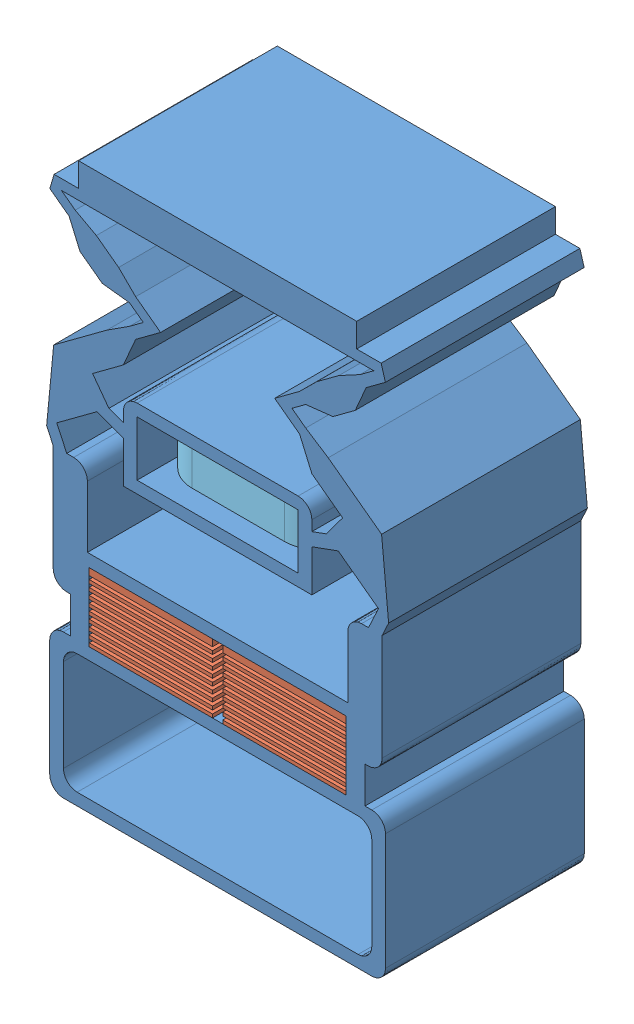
SolidWorks assembly crawling robot_de.SLDASM, configuration 默认 (file format 15000). Lengths in mm.
Overall size (9.98 16.33 5.8).
12 component instances, 5 part files, 8 mates.
Components (placement in the parent):
- joint for crawling_de-1: joint for crawling_de.SLDPRT [默认] at (0.8844 -2.7794 14.4192) size (9.98 16.33 5.8)
- integrated coil 1-1: integrated coil 1.SLDASM [默认] at (-1.1576 -2.4266 11.8192) x (0 -1 0) z (0 0 1) size (2.18 3.6 5.6)
  - coil_2-1: coil_2.SLDPRT [默认] at (0.3628 -1.7081 5.6) size (2 3.6 5.6)
  - Iron_plate_optimized_2-1: Iron_plate_optimized_2.SLDPRT [默认] at (0.3628 -0.9581 5.6) size (2 2.1 4.1)
  - small iron ball-1: small iron ball.SLDPRT [默认] at (0.3628 0.0419 6.65) x (0.996725 -0.079787 0.013181) z (-0.014188 -0.012072 0.999826) size (2 2 2)
  - small iron ball-2: small iron ball.SLDPRT [默认] at (0.3628 0.0419 4.65) size (2 2 2)
- magnets-1: magnets.SLDPRT [默认] at (0.8844 1.1206 17.2691) size (4.7 1.6 4.7)
- integrated coil 1-2: integrated coil 1.SLDASM [默认] at (2.7424 -2.4266 11.8192) x (0 -1 0) z (0 0 1) size (2.18 3.6 5.6)
  - coil_2-1: coil_2.SLDPRT [默认] at (0.3628 -1.7081 5.6) size (2 3.6 5.6)
  - Iron_plate_optimized_2-1: Iron_plate_optimized_2.SLDPRT [默认] at (0.3628 -0.9581 5.6) size (2 2.1 4.1)
  - small iron ball-1: small iron ball.SLDPRT [默认] at (0.3628 0.0419 6.65) x (0.996725 -0.079787 0.013181) z (-0.014188 -0.012072 0.999826) size (2 2 2)
  - small iron ball-2: small iron ball.SLDPRT [默认] at (0.3628 0.0419 4.65) size (2 2 2)
Mates (geometry in assembly coordinates):
- 重合1: coincident anti-aligned: plane of joint for crawling_de-1 through (-2.8656 -1.7894 6.8192) normal (0 -1 0); plane of integrated coil 1-1/coil_2-1 through (0.7344 -1.7894 20.2192) normal (0 1 0)
- 重合2: coincident anti-aligned: plane of joint for crawling_de-1 through (-2.8656 -3.7794 14.4192) normal (1 0 0); plane of integrated coil 1-1/coil_2-1 through (-2.8656 -2.7894 17.4192) normal (-1 0 0)
- 重合3: coincident aligned: plane of joint for crawling_de-1 through (0.8844 -2.7794 20.2192) normal (0 0 1); plane of integrated coil 1-1/coil_2-1 through (0.7344 -1.7894 20.2192) normal (0 0 1)
- 重合4: coincident anti-aligned: plane of joint for crawling_de-1 through (-2.8656 -1.7894 6.8192) normal (0 -1 0); plane of integrated coil 1-2/coil_2-1 through (4.6344 -1.7894 20.2192) normal (0 1 0)
- 重合5: coincident anti-aligned: plane of joint for crawling_de-1 through (4.6344 -3.7794 14.4192) normal (-1 0 0); plane of integrated coil 1-2/coil_2-1 through (4.6344 -2.7894 17.4192) normal (1 0 0)
- 重合6: coincident aligned: plane of joint for crawling_de-1 through (0.8844 -2.7794 20.2192) normal (0 0 1); plane of integrated coil 1-2/coil_2-1 through (4.6344 -1.7894 20.2192) normal (0 0 1)
- 重合7: coincident anti-aligned: plane of joint for crawling_de-1 through (-1.4656 1.1206 14.4192) normal (0 1 0); plane of magnets-1 through (0.8844 1.1206 17.2691) normal (0 -1 0)
- 重合8: coincident anti-aligned: plane of joint for crawling_de-1 through (-1.4656 2.7206 14.4192) normal (1 0 0); plane of magnets-1 through (-1.4656 2.7206 19.6191) normal (-1 0 0)
